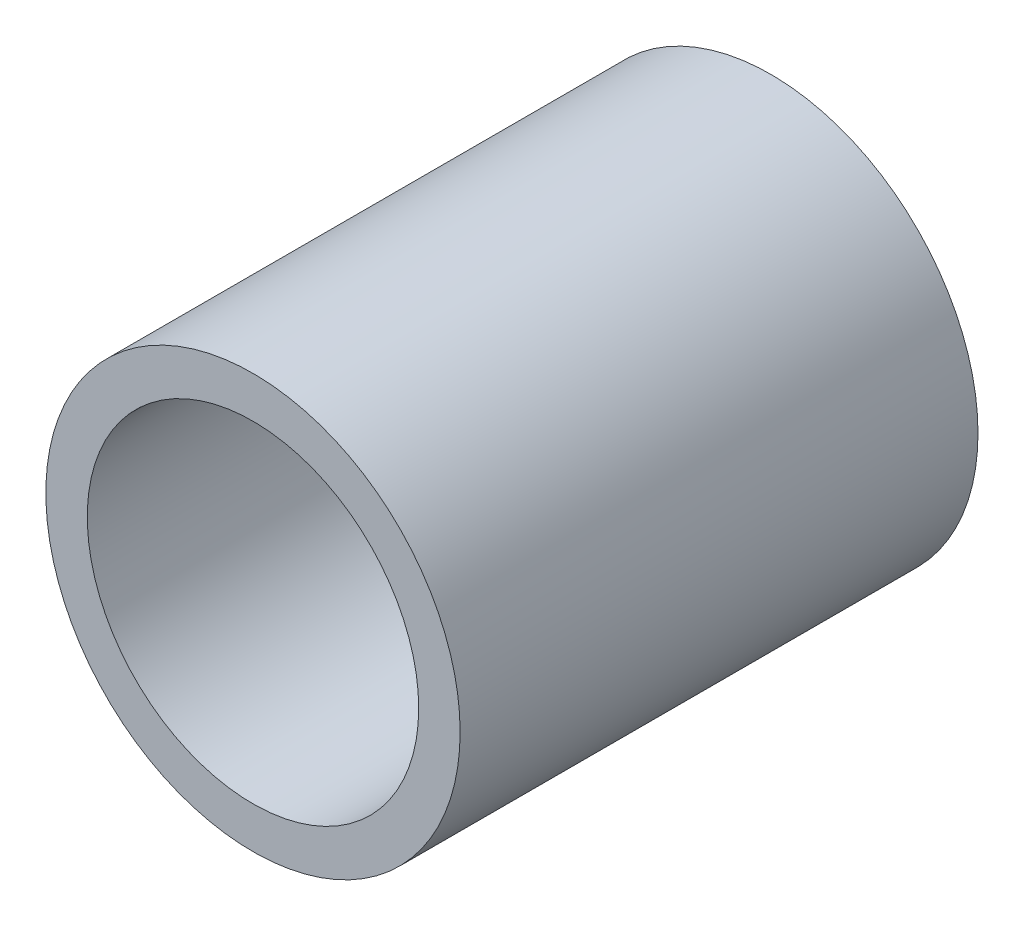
ISO-10303-21;
HEADER;
FILE_DESCRIPTION(('STEP AP214'),'2;1');
FILE_NAME('part.step','',(''),(''),'','','');
FILE_SCHEMA(('AUTOMOTIVE_DESIGN { 1 0 10303 214 1 1 1 1 }'));
ENDSEC;
DATA;
#1=APPLICATION_CONTEXT('core data for automotive mechanical design processes');
#2=APPLICATION_PROTOCOL_DEFINITION('international standard','automotive_design',2000,#1);
#3=PRODUCT_CONTEXT('',#1,'mechanical');
#4=PRODUCT('Part','Part','',(#3));
#5=PRODUCT_RELATED_PRODUCT_CATEGORY('part','',(#4));
#6=PRODUCT_DEFINITION_FORMATION('','',#4);
#7=PRODUCT_DEFINITION_CONTEXT('part definition',#1,'design');
#8=PRODUCT_DEFINITION('design','',#6,#7);
#9=PRODUCT_DEFINITION_SHAPE('','',#8);
#10=(LENGTH_UNIT() NAMED_UNIT(*) SI_UNIT(.MILLI.,.METRE.));
#11=(NAMED_UNIT(*) PLANE_ANGLE_UNIT() SI_UNIT($,.RADIAN.));
#12=(NAMED_UNIT(*) SI_UNIT($,.STERADIAN.) SOLID_ANGLE_UNIT());
#13=UNCERTAINTY_MEASURE_WITH_UNIT(LENGTH_MEASURE(1.E-05),#10,'distance_accuracy_value','');
#14=(GEOMETRIC_REPRESENTATION_CONTEXT(3) GLOBAL_UNCERTAINTY_ASSIGNED_CONTEXT((#13)) GLOBAL_UNIT_ASSIGNED_CONTEXT((#10,
#11,#12)) REPRESENTATION_CONTEXT('',''));
#15=CARTESIAN_POINT('',(0.,0.,0.));
#16=DIRECTION('',(0.,0.,1.));
#17=DIRECTION('',(1.,0.,0.));
#18=AXIS2_PLACEMENT_3D('',#15,#16,#17);
#19=CARTESIAN_POINT('',(0.,0.,5.));
#20=DIRECTION('',(0.,0.,-1.));
#21=DIRECTION('',(-1.,0.,0.));
#22=AXIS2_PLACEMENT_3D('',#19,#20,#21);
#23=CYLINDRICAL_SURFACE('',#22,2.);
#24=CARTESIAN_POINT('',(0.,0.,5.));
#25=DIRECTION('',(0.,0.,1.));
#26=DIRECTION('',(1.,0.,0.));
#27=AXIS2_PLACEMENT_3D('',#24,#25,#26);
#28=CIRCLE('',#27,2.);
#29=CARTESIAN_POINT('',(2.,0.,5.));
#30=VERTEX_POINT('',#29);
#31=EDGE_CURVE('E10',#30,#30,#28,.T.);
#32=ORIENTED_EDGE('',*,*,#31,.F.);
#33=EDGE_LOOP('',(#32));
#34=FACE_BOUND('',#33,.T.);
#35=CARTESIAN_POINT('',(0.,0.,0.));
#36=DIRECTION('',(0.,0.,1.));
#37=DIRECTION('',(1.,0.,0.));
#38=AXIS2_PLACEMENT_3D('',#35,#36,#37);
#39=CIRCLE('',#38,2.);
#40=CARTESIAN_POINT('',(2.,0.,0.));
#41=VERTEX_POINT('',#40);
#42=EDGE_CURVE('E39',#41,#41,#39,.T.);
#43=ORIENTED_EDGE('',*,*,#42,.T.);
#44=EDGE_LOOP('',(#43));
#45=FACE_BOUND('',#44,.T.);
#46=ADVANCED_FACE('F33',(#34,#45),#23,.T.);
#47=CARTESIAN_POINT('',(0.,0.,5.));
#48=DIRECTION('',(0.,0.,1.));
#49=DIRECTION('',(1.,0.,0.));
#50=AXIS2_PLACEMENT_3D('',#47,#48,#49);
#51=PLANE('',#50);
#52=CARTESIAN_POINT('',(0.,0.,5.));
#53=DIRECTION('',(0.,0.,1.));
#54=DIRECTION('',(1.,0.,0.));
#55=AXIS2_PLACEMENT_3D('',#52,#53,#54);
#56=CIRCLE('',#55,1.6);
#57=CARTESIAN_POINT('',(1.6,0.,5.));
#58=VERTEX_POINT('',#57);
#59=EDGE_CURVE('E47',#58,#58,#56,.T.);
#60=ORIENTED_EDGE('',*,*,#59,.F.);
#61=EDGE_LOOP('',(#60));
#62=FACE_BOUND('',#61,.T.);
#63=ORIENTED_EDGE('',*,*,#31,.T.);
#64=EDGE_LOOP('',(#63));
#65=FACE_BOUND('',#64,.T.);
#66=ADVANCED_FACE('F55',(#62,#65),#51,.T.);
#67=CARTESIAN_POINT('',(0.,0.,0.));
#68=DIRECTION('',(0.,0.,1.));
#69=DIRECTION('',(1.,0.,0.));
#70=AXIS2_PLACEMENT_3D('',#67,#68,#69);
#71=PLANE('',#70);
#72=CARTESIAN_POINT('',(0.,0.,0.));
#73=DIRECTION('',(0.,0.,1.));
#74=DIRECTION('',(1.,0.,0.));
#75=AXIS2_PLACEMENT_3D('',#72,#73,#74);
#76=CIRCLE('',#75,1.6);
#77=CARTESIAN_POINT('',(1.6,0.,0.));
#78=VERTEX_POINT('',#77);
#79=EDGE_CURVE('E43',#78,#78,#76,.T.);
#80=ORIENTED_EDGE('',*,*,#79,.T.);
#81=EDGE_LOOP('',(#80));
#82=FACE_BOUND('',#81,.T.);
#83=ORIENTED_EDGE('',*,*,#42,.F.);
#84=EDGE_LOOP('',(#83));
#85=FACE_BOUND('',#84,.T.);
#86=ADVANCED_FACE('F57',(#82,#85),#71,.F.);
#87=CARTESIAN_POINT('',(0.,0.,0.));
#88=DIRECTION('',(0.,0.,1.));
#89=DIRECTION('',(1.,0.,0.));
#90=AXIS2_PLACEMENT_3D('',#87,#88,#89);
#91=CYLINDRICAL_SURFACE('',#90,1.6);
#92=ORIENTED_EDGE('',*,*,#79,.F.);
#93=EDGE_LOOP('',(#92));
#94=FACE_BOUND('',#93,.T.);
#95=ORIENTED_EDGE('',*,*,#59,.T.);
#96=EDGE_LOOP('',(#95));
#97=FACE_BOUND('',#96,.T.);
#98=ADVANCED_FACE('F53',(#94,#97),#91,.F.);
#99=CLOSED_SHELL('',(#46,#66,#86,#98));
#100=MANIFOLD_SOLID_BREP('B2',#99);
#101=ADVANCED_BREP_SHAPE_REPRESENTATION('',(#18,#100),#14);
#102=SHAPE_DEFINITION_REPRESENTATION(#9,#101);
ENDSEC;
END-ISO-10303-21;
